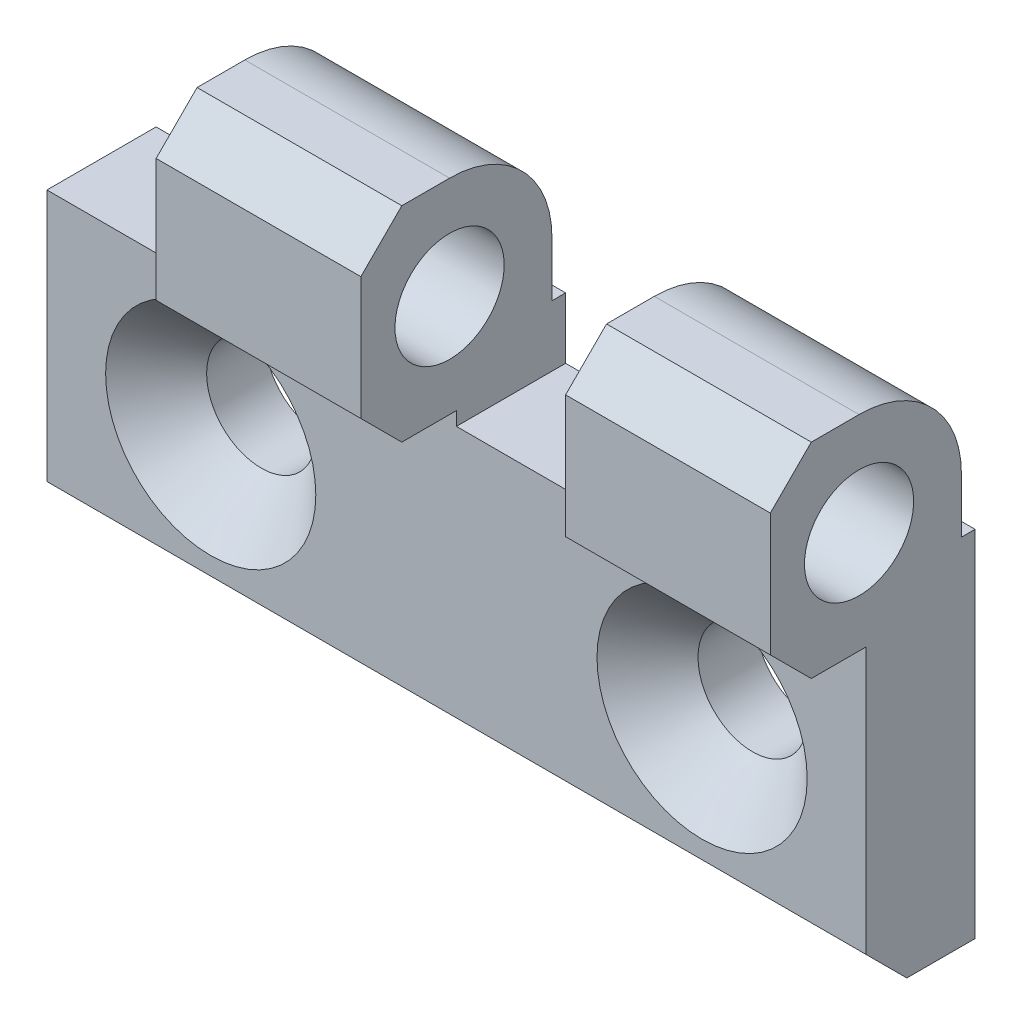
ISO-10303-21;
HEADER;
FILE_DESCRIPTION(('STEP AP214'),'2;1');
FILE_NAME('part.step','',(''),(''),'','','');
FILE_SCHEMA(('AUTOMOTIVE_DESIGN { 1 0 10303 214 1 1 1 1 }'));
ENDSEC;
DATA;
#1=APPLICATION_CONTEXT('core data for automotive mechanical design processes');
#2=APPLICATION_PROTOCOL_DEFINITION('international standard','automotive_design',2000,#1);
#3=PRODUCT_CONTEXT('',#1,'mechanical');
#4=PRODUCT('Part','Part','',(#3));
#5=PRODUCT_RELATED_PRODUCT_CATEGORY('part','',(#4));
#6=PRODUCT_DEFINITION_FORMATION('','',#4);
#7=PRODUCT_DEFINITION_CONTEXT('part definition',#1,'design');
#8=PRODUCT_DEFINITION('design','',#6,#7);
#9=PRODUCT_DEFINITION_SHAPE('','',#8);
#10=(LENGTH_UNIT() NAMED_UNIT(*) SI_UNIT(.MILLI.,.METRE.));
#11=(NAMED_UNIT(*) PLANE_ANGLE_UNIT() SI_UNIT($,.RADIAN.));
#12=(NAMED_UNIT(*) SI_UNIT($,.STERADIAN.) SOLID_ANGLE_UNIT());
#13=UNCERTAINTY_MEASURE_WITH_UNIT(LENGTH_MEASURE(1.E-05),#10,'distance_accuracy_value','');
#14=(GEOMETRIC_REPRESENTATION_CONTEXT(3) GLOBAL_UNCERTAINTY_ASSIGNED_CONTEXT((#13)) GLOBAL_UNIT_ASSIGNED_CONTEXT((#10,
#11,#12)) REPRESENTATION_CONTEXT('',''));
#15=CARTESIAN_POINT('',(0.,0.,0.));
#16=DIRECTION('',(0.,0.,1.));
#17=DIRECTION('',(1.,0.,0.));
#18=AXIS2_PLACEMENT_3D('',#15,#16,#17);
#19=CARTESIAN_POINT('',(-12.,-12.,8.));
#20=DIRECTION('',(0.,0.,-1.));
#21=DIRECTION('',(0.,1.,0.));
#22=AXIS2_PLACEMENT_3D('',#19,#20,#21);
#23=PLANE('',#22);
#24=CARTESIAN_POINT('',(36.,0.,8.));
#25=DIRECTION('',(0.,0.,-1.));
#26=DIRECTION('',(0.,1.,0.));
#27=AXIS2_PLACEMENT_3D('',#24,#25,#26);
#28=CIRCLE('',#27,7.7);
#29=CARTESIAN_POINT('',(36.,7.7,8.));
#30=VERTEX_POINT('',#29);
#31=EDGE_CURVE('E318',#30,#30,#28,.T.);
#32=ORIENTED_EDGE('',*,*,#31,.T.);
#33=EDGE_LOOP('',(#32));
#34=FACE_BOUND('',#33,.T.);
#35=CARTESIAN_POINT('',(0.,0.,8.));
#36=DIRECTION('',(0.,0.,-1.));
#37=DIRECTION('',(0.,1.,0.));
#38=AXIS2_PLACEMENT_3D('',#35,#36,#37);
#39=CIRCLE('',#38,7.7);
#40=CARTESIAN_POINT('',(0.,7.7,8.));
#41=VERTEX_POINT('',#40);
#42=EDGE_CURVE('E310',#41,#41,#39,.T.);
#43=ORIENTED_EDGE('',*,*,#42,.T.);
#44=EDGE_LOOP('',(#43));
#45=FACE_BOUND('',#44,.T.);
#46=DIRECTION('',(0.,1.,0.));
#47=VECTOR('',#46,1.);
#48=CARTESIAN_POINT('',(33.,-12.,8.));
#49=LINE('',#48,#47);
#50=CARTESIAN_POINT('',(33.,9.5,8.));
#51=VERTEX_POINT('',#50);
#52=CARTESIAN_POINT('',(33.,10.5,8.));
#53=VERTEX_POINT('',#52);
#54=EDGE_CURVE('E341',#51,#53,#49,.T.);
#55=ORIENTED_EDGE('',*,*,#54,.F.);
#56=DIRECTION('',(-1.,0.,0.));
#57=VECTOR('',#56,1.);
#58=CARTESIAN_POINT('',(-12.,9.5,8.));
#59=LINE('',#58,#57);
#60=CARTESIAN_POINT('',(18.,9.5,8.));
#61=VERTEX_POINT('',#60);
#62=EDGE_CURVE('E209',#51,#61,#59,.T.);
#63=ORIENTED_EDGE('',*,*,#62,.T.);
#64=DIRECTION('',(0.,1.,0.));
#65=VECTOR('',#64,1.);
#66=CARTESIAN_POINT('',(18.,-12.,8.));
#67=LINE('',#66,#65);
#68=CARTESIAN_POINT('',(18.,10.5,8.));
#69=VERTEX_POINT('',#68);
#70=EDGE_CURVE('E405',#61,#69,#67,.T.);
#71=ORIENTED_EDGE('',*,*,#70,.T.);
#72=DIRECTION('',(1.,0.,0.));
#73=VECTOR('',#72,1.);
#74=CARTESIAN_POINT('',(-12.,10.5,8.));
#75=LINE('',#74,#73);
#76=CARTESIAN_POINT('',(3.,10.5,8.));
#77=VERTEX_POINT('',#76);
#78=EDGE_CURVE('E271',#77,#69,#75,.T.);
#79=ORIENTED_EDGE('',*,*,#78,.F.);
#80=DIRECTION('',(0.,1.,0.));
#81=VECTOR('',#80,1.);
#82=CARTESIAN_POINT('',(3.,-12.,8.));
#83=LINE('',#82,#81);
#84=CARTESIAN_POINT('',(3.,9.5,8.));
#85=VERTEX_POINT('',#84);
#86=EDGE_CURVE('E380',#85,#77,#83,.T.);
#87=ORIENTED_EDGE('',*,*,#86,.F.);
#88=DIRECTION('',(-1.,0.,0.));
#89=VECTOR('',#88,1.);
#90=CARTESIAN_POINT('',(-12.,9.5,8.));
#91=LINE('',#90,#89);
#92=CARTESIAN_POINT('',(-12.,9.5,8.));
#93=VERTEX_POINT('',#92);
#94=EDGE_CURVE('E198',#85,#93,#91,.T.);
#95=ORIENTED_EDGE('',*,*,#94,.T.);
#96=DIRECTION('',(0.,1.,0.));
#97=VECTOR('',#96,1.);
#98=CARTESIAN_POINT('',(-12.,-12.,8.));
#99=LINE('',#98,#97);
#100=CARTESIAN_POINT('',(-12.,-9.,8.));
#101=VERTEX_POINT('',#100);
#102=EDGE_CURVE('E251',#101,#93,#99,.T.);
#103=ORIENTED_EDGE('',*,*,#102,.F.);
#104=DIRECTION('',(1.,0.,0.));
#105=VECTOR('',#104,1.);
#106=CARTESIAN_POINT('',(-12.,-9.,8.));
#107=LINE('',#106,#105);
#108=CARTESIAN_POINT('',(48.,-9.,8.));
#109=VERTEX_POINT('',#108);
#110=EDGE_CURVE('E272',#101,#109,#107,.T.);
#111=ORIENTED_EDGE('',*,*,#110,.T.);
#112=DIRECTION('',(0.,1.,0.));
#113=VECTOR('',#112,1.);
#114=CARTESIAN_POINT('',(48.,-12.,8.));
#115=LINE('',#114,#113);
#116=CARTESIAN_POINT('',(48.,10.5,8.));
#117=VERTEX_POINT('',#116);
#118=EDGE_CURVE('E224',#109,#117,#115,.T.);
#119=ORIENTED_EDGE('',*,*,#118,.T.);
#120=EDGE_CURVE('E269',#53,#117,#75,.T.);
#121=ORIENTED_EDGE('',*,*,#120,.F.);
#122=EDGE_LOOP('',(#55,#63,#71,#79,#87,#95,#103,#111,#119,#121));
#123=FACE_BOUND('',#122,.T.);
#124=ADVANCED_FACE('F14',(#34,#45,#123),#23,.F.);
#125=CARTESIAN_POINT('',(-12.,10.5,15.));
#126=DIRECTION('',(0.,-1.,0.));
#127=DIRECTION('',(0.,0.,-1.));
#128=AXIS2_PLACEMENT_3D('',#125,#126,#127);
#129=PLANE('',#128);
#130=DIRECTION('',(-1.,0.,0.));
#131=VECTOR('',#130,1.);
#132=CARTESIAN_POINT('',(-12.,10.5,12.));
#133=LINE('',#132,#131);
#134=CARTESIAN_POINT('',(48.,10.5,12.));
#135=VERTEX_POINT('',#134);
#136=CARTESIAN_POINT('',(33.,10.5,12.));
#137=VERTEX_POINT('',#136);
#138=EDGE_CURVE('E292',#135,#137,#133,.T.);
#139=ORIENTED_EDGE('',*,*,#138,.T.);
#140=DIRECTION('',(0.,0.,-1.));
#141=VECTOR('',#140,1.);
#142=CARTESIAN_POINT('',(33.,10.5,15.));
#143=LINE('',#142,#141);
#144=EDGE_CURVE('E347',#137,#53,#143,.T.);
#145=ORIENTED_EDGE('',*,*,#144,.T.);
#146=ORIENTED_EDGE('',*,*,#120,.T.);
#147=DIRECTION('',(0.,0.,-1.));
#148=VECTOR('',#147,1.);
#149=CARTESIAN_POINT('',(48.,10.5,15.));
#150=LINE('',#149,#148);
#151=EDGE_CURVE('E227',#135,#117,#150,.T.);
#152=ORIENTED_EDGE('',*,*,#151,.F.);
#153=EDGE_LOOP('',(#139,#145,#146,#152));
#154=FACE_BOUND('',#153,.T.);
#155=ADVANCED_FACE('F336',(#154),#129,.T.);
#156=DIRECTION('',(0.,0.,-1.));
#157=VECTOR('',#156,1.);
#158=CARTESIAN_POINT('',(18.,10.5,15.));
#159=LINE('',#158,#157);
#160=CARTESIAN_POINT('',(18.,10.5,12.));
#161=VERTEX_POINT('',#160);
#162=EDGE_CURVE('E403',#161,#69,#159,.T.);
#163=ORIENTED_EDGE('',*,*,#162,.F.);
#164=CARTESIAN_POINT('',(3.,10.5,12.));
#165=VERTEX_POINT('',#164);
#166=EDGE_CURVE('E296',#161,#165,#133,.T.);
#167=ORIENTED_EDGE('',*,*,#166,.T.);
#168=DIRECTION('',(0.,0.,-1.));
#169=VECTOR('',#168,1.);
#170=CARTESIAN_POINT('',(3.,10.5,15.));
#171=LINE('',#170,#169);
#172=EDGE_CURVE('E384',#165,#77,#171,.T.);
#173=ORIENTED_EDGE('',*,*,#172,.T.);
#174=ORIENTED_EDGE('',*,*,#78,.T.);
#175=EDGE_LOOP('',(#163,#167,#173,#174));
#176=FACE_BOUND('',#175,.T.);
#177=ADVANCED_FACE('F501',(#176),#129,.T.);
#178=CARTESIAN_POINT('',(-12.,10.5,15.));
#179=DIRECTION('',(0.,0.,-1.));
#180=DIRECTION('',(0.,1.,0.));
#181=AXIS2_PLACEMENT_3D('',#178,#179,#180);
#182=PLANE('',#181);
#183=DIRECTION('',(0.,1.,0.));
#184=VECTOR('',#183,1.);
#185=CARTESIAN_POINT('',(33.,10.5,15.));
#186=LINE('',#185,#184);
#187=CARTESIAN_POINT('',(33.,13.5,15.));
#188=VERTEX_POINT('',#187);
#189=CARTESIAN_POINT('',(33.,22.5,15.));
#190=VERTEX_POINT('',#189);
#191=EDGE_CURVE('E420',#188,#190,#186,.T.);
#192=ORIENTED_EDGE('',*,*,#191,.F.);
#193=DIRECTION('',(1.,0.,0.));
#194=VECTOR('',#193,1.);
#195=CARTESIAN_POINT('',(48.,13.5,15.));
#196=LINE('',#195,#194);
#197=CARTESIAN_POINT('',(48.,13.5,15.));
#198=VERTEX_POINT('',#197);
#199=EDGE_CURVE('E289',#188,#198,#196,.T.);
#200=ORIENTED_EDGE('',*,*,#199,.T.);
#201=DIRECTION('',(0.,1.,0.));
#202=VECTOR('',#201,1.);
#203=CARTESIAN_POINT('',(48.,10.5,15.));
#204=LINE('',#203,#202);
#205=CARTESIAN_POINT('',(48.,22.5,15.));
#206=VERTEX_POINT('',#205);
#207=EDGE_CURVE('E230',#198,#206,#204,.T.);
#208=ORIENTED_EDGE('',*,*,#207,.T.);
#209=DIRECTION('',(-1.,0.,0.));
#210=VECTOR('',#209,1.);
#211=CARTESIAN_POINT('',(-12.,22.5,15.));
#212=LINE('',#211,#210);
#213=EDGE_CURVE('E286',#206,#190,#212,.T.);
#214=ORIENTED_EDGE('',*,*,#213,.T.);
#215=EDGE_LOOP('',(#192,#200,#208,#214));
#216=FACE_BOUND('',#215,.T.);
#217=ADVANCED_FACE('F447',(#216),#182,.F.);
#218=CARTESIAN_POINT('',(3.,13.5,15.));
#219=VERTEX_POINT('',#218);
#220=CARTESIAN_POINT('',(18.,13.5,15.));
#221=VERTEX_POINT('',#220);
#222=EDGE_CURVE('E291',#219,#221,#196,.T.);
#223=ORIENTED_EDGE('',*,*,#222,.T.);
#224=DIRECTION('',(0.,1.,0.));
#225=VECTOR('',#224,1.);
#226=CARTESIAN_POINT('',(18.,10.5,15.));
#227=LINE('',#226,#225);
#228=CARTESIAN_POINT('',(18.,22.5,15.));
#229=VERTEX_POINT('',#228);
#230=EDGE_CURVE('E395',#221,#229,#227,.T.);
#231=ORIENTED_EDGE('',*,*,#230,.T.);
#232=CARTESIAN_POINT('',(3.,22.5,15.));
#233=VERTEX_POINT('',#232);
#234=EDGE_CURVE('E285',#229,#233,#212,.T.);
#235=ORIENTED_EDGE('',*,*,#234,.T.);
#236=DIRECTION('',(0.,1.,0.));
#237=VECTOR('',#236,1.);
#238=CARTESIAN_POINT('',(3.,10.5,15.));
#239=LINE('',#238,#237);
#240=EDGE_CURVE('E36',#219,#233,#239,.T.);
#241=ORIENTED_EDGE('',*,*,#240,.F.);
#242=EDGE_LOOP('',(#223,#231,#235,#241));
#243=FACE_BOUND('',#242,.T.);
#244=ADVANCED_FACE('F499',(#243),#182,.F.);
#245=CARTESIAN_POINT('',(-12.,25.5,15.));
#246=DIRECTION('',(0.,-1.,0.));
#247=DIRECTION('',(0.,0.,-1.));
#248=AXIS2_PLACEMENT_3D('',#245,#246,#247);
#249=PLANE('',#248);
#250=DIRECTION('',(0.,0.,-1.));
#251=VECTOR('',#250,1.);
#252=CARTESIAN_POINT('',(33.,25.5,15.));
#253=LINE('',#252,#251);
#254=CARTESIAN_POINT('',(33.,25.5,12.));
#255=VERTEX_POINT('',#254);
#256=CARTESIAN_POINT('',(33.,25.5,8.5));
#257=VERTEX_POINT('',#256);
#258=EDGE_CURVE('E418',#255,#257,#253,.T.);
#259=ORIENTED_EDGE('',*,*,#258,.F.);
#260=DIRECTION('',(1.,0.,0.));
#261=VECTOR('',#260,1.);
#262=CARTESIAN_POINT('',(-12.,25.5,12.));
#263=LINE('',#262,#261);
#264=CARTESIAN_POINT('',(48.,25.5,12.));
#265=VERTEX_POINT('',#264);
#266=EDGE_CURVE('E295',#255,#265,#263,.T.);
#267=ORIENTED_EDGE('',*,*,#266,.T.);
#268=DIRECTION('',(0.,0.,-1.));
#269=VECTOR('',#268,1.);
#270=CARTESIAN_POINT('',(48.,25.5,15.));
#271=LINE('',#270,#269);
#272=CARTESIAN_POINT('',(48.,25.5,8.5));
#273=VERTEX_POINT('',#272);
#274=EDGE_CURVE('E233',#265,#273,#271,.T.);
#275=ORIENTED_EDGE('',*,*,#274,.T.);
#276=DIRECTION('',(1.,0.,0.));
#277=VECTOR('',#276,1.);
#278=CARTESIAN_POINT('',(-12.,25.5,8.5));
#279=LINE('',#278,#277);
#280=EDGE_CURVE('E266',#257,#273,#279,.T.);
#281=ORIENTED_EDGE('',*,*,#280,.F.);
#282=EDGE_LOOP('',(#259,#267,#275,#281));
#283=FACE_BOUND('',#282,.T.);
#284=ADVANCED_FACE('F440',(#283),#249,.F.);
#285=CARTESIAN_POINT('',(3.,25.5,12.));
#286=VERTEX_POINT('',#285);
#287=CARTESIAN_POINT('',(18.,25.5,12.));
#288=VERTEX_POINT('',#287);
#289=EDGE_CURVE('E298',#286,#288,#263,.T.);
#290=ORIENTED_EDGE('',*,*,#289,.T.);
#291=DIRECTION('',(0.,0.,-1.));
#292=VECTOR('',#291,1.);
#293=CARTESIAN_POINT('',(18.,25.5,15.));
#294=LINE('',#293,#292);
#295=CARTESIAN_POINT('',(18.,25.5,8.5));
#296=VERTEX_POINT('',#295);
#297=EDGE_CURVE('E28',#288,#296,#294,.T.);
#298=ORIENTED_EDGE('',*,*,#297,.T.);
#299=CARTESIAN_POINT('',(3.,25.5,8.5));
#300=VERTEX_POINT('',#299);
#301=EDGE_CURVE('E268',#300,#296,#279,.T.);
#302=ORIENTED_EDGE('',*,*,#301,.F.);
#303=DIRECTION('',(0.,0.,-1.));
#304=VECTOR('',#303,1.);
#305=CARTESIAN_POINT('',(3.,25.5,15.));
#306=LINE('',#305,#304);
#307=EDGE_CURVE('E522',#286,#300,#306,.T.);
#308=ORIENTED_EDGE('',*,*,#307,.F.);
#309=EDGE_LOOP('',(#290,#298,#302,#308));
#310=FACE_BOUND('',#309,.T.);
#311=ADVANCED_FACE('F496',(#310),#249,.F.);
#312=CARTESIAN_POINT('',(-12.,18.,8.5));
#313=DIRECTION('',(1.,0.,0.));
#314=DIRECTION('',(0.,1.,0.));
#315=AXIS2_PLACEMENT_3D('',#312,#313,#314);
#316=CYLINDRICAL_SURFACE('',#315,7.5);
#317=CARTESIAN_POINT('',(33.,18.,8.5));
#318=DIRECTION('',(-1.,0.,0.));
#319=DIRECTION('',(0.,-1.,0.));
#320=AXIS2_PLACEMENT_3D('',#317,#318,#319);
#321=CIRCLE('',#320,7.5);
#322=CARTESIAN_POINT('',(33.,18.,1.));
#323=VERTEX_POINT('',#322);
#324=EDGE_CURVE('E351',#257,#323,#321,.T.);
#325=ORIENTED_EDGE('',*,*,#324,.F.);
#326=ORIENTED_EDGE('',*,*,#280,.T.);
#327=CARTESIAN_POINT('',(48.,18.,8.5));
#328=DIRECTION('',(-1.,0.,0.));
#329=DIRECTION('',(0.,-1.,0.));
#330=AXIS2_PLACEMENT_3D('',#327,#328,#329);
#331=CIRCLE('',#330,7.5);
#332=CARTESIAN_POINT('',(48.,18.,1.));
#333=VERTEX_POINT('',#332);
#334=EDGE_CURVE('E236',#273,#333,#331,.T.);
#335=ORIENTED_EDGE('',*,*,#334,.T.);
#336=DIRECTION('',(1.,0.,0.));
#337=VECTOR('',#336,1.);
#338=CARTESIAN_POINT('',(-12.,18.,1.));
#339=LINE('',#338,#337);
#340=EDGE_CURVE('E263',#323,#333,#339,.T.);
#341=ORIENTED_EDGE('',*,*,#340,.F.);
#342=EDGE_LOOP('',(#325,#326,#335,#341));
#343=FACE_BOUND('',#342,.T.);
#344=ADVANCED_FACE('F434',(#343),#316,.T.);
#345=ORIENTED_EDGE('',*,*,#301,.T.);
#346=CARTESIAN_POINT('',(18.,18.,8.5));
#347=DIRECTION('',(-1.,0.,0.));
#348=DIRECTION('',(0.,-1.,0.));
#349=AXIS2_PLACEMENT_3D('',#346,#347,#348);
#350=CIRCLE('',#349,7.5);
#351=CARTESIAN_POINT('',(18.,18.,1.));
#352=VERTEX_POINT('',#351);
#353=EDGE_CURVE('E400',#296,#352,#350,.T.);
#354=ORIENTED_EDGE('',*,*,#353,.T.);
#355=CARTESIAN_POINT('',(3.,18.,1.));
#356=VERTEX_POINT('',#355);
#357=EDGE_CURVE('E265',#356,#352,#339,.T.);
#358=ORIENTED_EDGE('',*,*,#357,.F.);
#359=CARTESIAN_POINT('',(3.,18.,8.5));
#360=DIRECTION('',(-1.,0.,0.));
#361=DIRECTION('',(0.,-1.,0.));
#362=AXIS2_PLACEMENT_3D('',#359,#360,#361);
#363=CIRCLE('',#362,7.5);
#364=EDGE_CURVE('E387',#300,#356,#363,.T.);
#365=ORIENTED_EDGE('',*,*,#364,.F.);
#366=EDGE_LOOP('',(#345,#354,#358,#365));
#367=FACE_BOUND('',#366,.T.);
#368=ADVANCED_FACE('F493',(#367),#316,.T.);
#369=CARTESIAN_POINT('',(-12.,18.,1.));
#370=DIRECTION('',(0.,0.,1.));
#371=DIRECTION('',(0.,-1.,0.));
#372=AXIS2_PLACEMENT_3D('',#369,#370,#371);
#373=PLANE('',#372);
#374=DIRECTION('',(0.,-1.,0.));
#375=VECTOR('',#374,1.);
#376=CARTESIAN_POINT('',(33.,18.,1.));
#377=LINE('',#376,#375);
#378=CARTESIAN_POINT('',(33.,13.97,1.));
#379=VERTEX_POINT('',#378);
#380=EDGE_CURVE('E346',#323,#379,#377,.T.);
#381=ORIENTED_EDGE('',*,*,#380,.F.);
#382=ORIENTED_EDGE('',*,*,#340,.T.);
#383=DIRECTION('',(0.,-1.,0.));
#384=VECTOR('',#383,1.);
#385=CARTESIAN_POINT('',(48.,18.,1.));
#386=LINE('',#385,#384);
#387=CARTESIAN_POINT('',(48.,13.97,1.));
#388=VERTEX_POINT('',#387);
#389=EDGE_CURVE('E239',#333,#388,#386,.T.);
#390=ORIENTED_EDGE('',*,*,#389,.T.);
#391=DIRECTION('',(1.,0.,0.));
#392=VECTOR('',#391,1.);
#393=CARTESIAN_POINT('',(-12.,13.97,1.));
#394=LINE('',#393,#392);
#395=EDGE_CURVE('E260',#379,#388,#394,.T.);
#396=ORIENTED_EDGE('',*,*,#395,.F.);
#397=EDGE_LOOP('',(#381,#382,#390,#396));
#398=FACE_BOUND('',#397,.T.);
#399=ADVANCED_FACE('F433',(#398),#373,.F.);
#400=ORIENTED_EDGE('',*,*,#357,.T.);
#401=DIRECTION('',(0.,-1.,0.));
#402=VECTOR('',#401,1.);
#403=CARTESIAN_POINT('',(18.,18.,1.));
#404=LINE('',#403,#402);
#405=CARTESIAN_POINT('',(18.,13.97,1.));
#406=VERTEX_POINT('',#405);
#407=EDGE_CURVE('E407',#352,#406,#404,.T.);
#408=ORIENTED_EDGE('',*,*,#407,.T.);
#409=CARTESIAN_POINT('',(3.,13.97,1.));
#410=VERTEX_POINT('',#409);
#411=EDGE_CURVE('E262',#410,#406,#394,.T.);
#412=ORIENTED_EDGE('',*,*,#411,.F.);
#413=DIRECTION('',(0.,-1.,0.));
#414=VECTOR('',#413,1.);
#415=CARTESIAN_POINT('',(3.,18.,1.));
#416=LINE('',#415,#414);
#417=EDGE_CURVE('E383',#356,#410,#416,.T.);
#418=ORIENTED_EDGE('',*,*,#417,.F.);
#419=EDGE_LOOP('',(#400,#408,#412,#418));
#420=FACE_BOUND('',#419,.T.);
#421=ADVANCED_FACE('F490',(#420),#373,.F.);
#422=CARTESIAN_POINT('',(-12.,13.97,1.));
#423=DIRECTION('',(0.,-1.,0.));
#424=DIRECTION('',(1.,0.,0.));
#425=AXIS2_PLACEMENT_3D('',#422,#423,#424);
#426=PLANE('',#425);
#427=DIRECTION('',(0.,0.,-1.));
#428=VECTOR('',#427,1.);
#429=CARTESIAN_POINT('',(33.,13.97,1.));
#430=LINE('',#429,#428);
#431=CARTESIAN_POINT('',(33.,13.97,0.));
#432=VERTEX_POINT('',#431);
#433=EDGE_CURVE('E349',#379,#432,#430,.T.);
#434=ORIENTED_EDGE('',*,*,#433,.F.);
#435=ORIENTED_EDGE('',*,*,#395,.T.);
#436=DIRECTION('',(0.,0.,-1.));
#437=VECTOR('',#436,1.);
#438=CARTESIAN_POINT('',(48.,13.97,1.));
#439=LINE('',#438,#437);
#440=CARTESIAN_POINT('',(48.,13.97,0.));
#441=VERTEX_POINT('',#440);
#442=EDGE_CURVE('E242',#388,#441,#439,.T.);
#443=ORIENTED_EDGE('',*,*,#442,.T.);
#444=DIRECTION('',(1.,0.,0.));
#445=VECTOR('',#444,1.);
#446=CARTESIAN_POINT('',(-12.,13.97,0.));
#447=LINE('',#446,#445);
#448=EDGE_CURVE('E257',#432,#441,#447,.T.);
#449=ORIENTED_EDGE('',*,*,#448,.F.);
#450=EDGE_LOOP('',(#434,#435,#443,#449));
#451=FACE_BOUND('',#450,.T.);
#452=ADVANCED_FACE('F362',(#451),#426,.F.);
#453=ORIENTED_EDGE('',*,*,#411,.T.);
#454=DIRECTION('',(0.,0.,-1.));
#455=VECTOR('',#454,1.);
#456=CARTESIAN_POINT('',(18.,13.97,1.));
#457=LINE('',#456,#455);
#458=CARTESIAN_POINT('',(18.,13.97,0.));
#459=VERTEX_POINT('',#458);
#460=EDGE_CURVE('E410',#406,#459,#457,.T.);
#461=ORIENTED_EDGE('',*,*,#460,.T.);
#462=CARTESIAN_POINT('',(3.,13.97,0.));
#463=VERTEX_POINT('',#462);
#464=EDGE_CURVE('E259',#463,#459,#447,.T.);
#465=ORIENTED_EDGE('',*,*,#464,.F.);
#466=DIRECTION('',(0.,0.,-1.));
#467=VECTOR('',#466,1.);
#468=CARTESIAN_POINT('',(3.,13.97,1.));
#469=LINE('',#468,#467);
#470=EDGE_CURVE('E186',#410,#463,#469,.T.);
#471=ORIENTED_EDGE('',*,*,#470,.F.);
#472=EDGE_LOOP('',(#453,#461,#465,#471));
#473=FACE_BOUND('',#472,.T.);
#474=ADVANCED_FACE('F486',(#473),#426,.F.);
#475=CARTESIAN_POINT('',(-12.,-12.,0.));
#476=DIRECTION('',(0.,0.,-1.));
#477=DIRECTION('',(-1.,0.,0.));
#478=AXIS2_PLACEMENT_3D('',#475,#476,#477);
#479=PLANE('',#478);
#480=CARTESIAN_POINT('',(0.,0.,0.));
#481=DIRECTION('',(0.,0.,-1.));
#482=DIRECTION('',(-1.,0.,0.));
#483=AXIS2_PLACEMENT_3D('',#480,#481,#482);
#484=CIRCLE('',#483,4.);
#485=CARTESIAN_POINT('',(-4.,0.,0.));
#486=VERTEX_POINT('',#485);
#487=EDGE_CURVE('E313',#486,#486,#484,.T.);
#488=ORIENTED_EDGE('',*,*,#487,.F.);
#489=EDGE_LOOP('',(#488));
#490=FACE_BOUND('',#489,.T.);
#491=CARTESIAN_POINT('',(36.,0.,0.));
#492=DIRECTION('',(0.,0.,-1.));
#493=DIRECTION('',(-1.,0.,0.));
#494=AXIS2_PLACEMENT_3D('',#491,#492,#493);
#495=CIRCLE('',#494,4.);
#496=CARTESIAN_POINT('',(32.,0.,0.));
#497=VERTEX_POINT('',#496);
#498=EDGE_CURVE('E200',#497,#497,#495,.T.);
#499=ORIENTED_EDGE('',*,*,#498,.F.);
#500=EDGE_LOOP('',(#499));
#501=FACE_BOUND('',#500,.T.);
#502=DIRECTION('',(-1.,0.,0.));
#503=VECTOR('',#502,1.);
#504=CARTESIAN_POINT('',(-12.,9.5,0.));
#505=LINE('',#504,#503);
#506=CARTESIAN_POINT('',(33.,9.5,0.));
#507=VERTEX_POINT('',#506);
#508=CARTESIAN_POINT('',(18.,9.5,0.));
#509=VERTEX_POINT('',#508);
#510=EDGE_CURVE('E308',#507,#509,#505,.T.);
#511=ORIENTED_EDGE('',*,*,#510,.F.);
#512=DIRECTION('',(0.,1.,0.));
#513=VECTOR('',#512,1.);
#514=CARTESIAN_POINT('',(33.,-12.,0.));
#515=LINE('',#514,#513);
#516=EDGE_CURVE('E212',#507,#432,#515,.T.);
#517=ORIENTED_EDGE('',*,*,#516,.T.);
#518=ORIENTED_EDGE('',*,*,#448,.T.);
#519=DIRECTION('',(0.,1.,0.));
#520=VECTOR('',#519,1.);
#521=CARTESIAN_POINT('',(48.,-12.,0.));
#522=LINE('',#521,#520);
#523=CARTESIAN_POINT('',(48.,-12.,0.));
#524=VERTEX_POINT('',#523);
#525=EDGE_CURVE('E245',#524,#441,#522,.T.);
#526=ORIENTED_EDGE('',*,*,#525,.F.);
#527=DIRECTION('',(1.,0.,0.));
#528=VECTOR('',#527,1.);
#529=CARTESIAN_POINT('',(-12.,-12.,0.));
#530=LINE('',#529,#528);
#531=CARTESIAN_POINT('',(-12.,-12.,0.));
#532=VERTEX_POINT('',#531);
#533=EDGE_CURVE('E255',#532,#524,#530,.T.);
#534=ORIENTED_EDGE('',*,*,#533,.F.);
#535=DIRECTION('',(0.,1.,0.));
#536=VECTOR('',#535,1.);
#537=CARTESIAN_POINT('',(-12.,-12.,0.));
#538=LINE('',#537,#536);
#539=CARTESIAN_POINT('',(-12.,9.5,0.));
#540=VERTEX_POINT('',#539);
#541=EDGE_CURVE('E206',#532,#540,#538,.T.);
#542=ORIENTED_EDGE('',*,*,#541,.T.);
#543=DIRECTION('',(-1.,0.,0.));
#544=VECTOR('',#543,1.);
#545=CARTESIAN_POINT('',(-12.,9.5,0.));
#546=LINE('',#545,#544);
#547=CARTESIAN_POINT('',(3.,9.5,0.));
#548=VERTEX_POINT('',#547);
#549=EDGE_CURVE('E195',#548,#540,#546,.T.);
#550=ORIENTED_EDGE('',*,*,#549,.F.);
#551=DIRECTION('',(0.,1.,0.));
#552=VECTOR('',#551,1.);
#553=CARTESIAN_POINT('',(3.,-12.,0.));
#554=LINE('',#553,#552);
#555=EDGE_CURVE('E179',#548,#463,#554,.T.);
#556=ORIENTED_EDGE('',*,*,#555,.T.);
#557=ORIENTED_EDGE('',*,*,#464,.T.);
#558=DIRECTION('',(0.,1.,0.));
#559=VECTOR('',#558,1.);
#560=CARTESIAN_POINT('',(18.,-12.,0.));
#561=LINE('',#560,#559);
#562=EDGE_CURVE('E413',#509,#459,#561,.T.);
#563=ORIENTED_EDGE('',*,*,#562,.F.);
#564=EDGE_LOOP('',(#511,#517,#518,#526,#534,#542,#550,#556,#557,#563));
#565=FACE_BOUND('',#564,.T.);
#566=ADVANCED_FACE('F204',(#490,#501,#565),#479,.T.);
#567=CARTESIAN_POINT('',(-12.,18.,8.5));
#568=DIRECTION('',(1.,0.,0.));
#569=DIRECTION('',(0.,1.,0.));
#570=AXIS2_PLACEMENT_3D('',#567,#568,#569);
#571=CYLINDRICAL_SURFACE('',#570,4.);
#572=CARTESIAN_POINT('',(48.,18.,8.5));
#573=DIRECTION('',(1.,0.,0.));
#574=DIRECTION('',(0.,1.,0.));
#575=AXIS2_PLACEMENT_3D('',#572,#573,#574);
#576=CIRCLE('',#575,4.);
#577=CARTESIAN_POINT('',(48.,22.,8.5));
#578=VERTEX_POINT('',#577);
#579=EDGE_CURVE('E218',#578,#578,#576,.T.);
#580=ORIENTED_EDGE('',*,*,#579,.T.);
#581=EDGE_LOOP('',(#580));
#582=FACE_BOUND('',#581,.T.);
#583=CARTESIAN_POINT('',(33.,18.,8.5));
#584=DIRECTION('',(-1.,0.,0.));
#585=DIRECTION('',(0.,-1.,0.));
#586=AXIS2_PLACEMENT_3D('',#583,#584,#585);
#587=CIRCLE('',#586,4.);
#588=CARTESIAN_POINT('',(33.,14.,8.5));
#589=VERTEX_POINT('',#588);
#590=EDGE_CURVE('E207',#589,#589,#587,.F.);
#591=ORIENTED_EDGE('',*,*,#590,.F.);
#592=EDGE_LOOP('',(#591));
#593=FACE_BOUND('',#592,.T.);
#594=ADVANCED_FACE('F457',(#582,#593),#571,.F.);
#595=CARTESIAN_POINT('',(-12.,13.5,15.));
#596=DIRECTION('',(0.,-0.707106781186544,0.707106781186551));
#597=DIRECTION('',(0.,-0.707106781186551,-0.707106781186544));
#598=AXIS2_PLACEMENT_3D('',#595,#596,#597);
#599=PLANE('',#598);
#600=ORIENTED_EDGE('',*,*,#199,.F.);
#601=DIRECTION('',(0.,-0.707106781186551,-0.707106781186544));
#602=VECTOR('',#601,1.);
#603=CARTESIAN_POINT('',(33.,13.5,15.));
#604=LINE('',#603,#602);
#605=EDGE_CURVE('E422',#188,#137,#604,.T.);
#606=ORIENTED_EDGE('',*,*,#605,.T.);
#607=ORIENTED_EDGE('',*,*,#138,.F.);
#608=DIRECTION('',(0.,-0.707106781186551,-0.707106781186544));
#609=VECTOR('',#608,1.);
#610=CARTESIAN_POINT('',(48.,13.5,15.));
#611=LINE('',#610,#609);
#612=EDGE_CURVE('E277',#198,#135,#611,.T.);
#613=ORIENTED_EDGE('',*,*,#612,.F.);
#614=EDGE_LOOP('',(#600,#606,#607,#613));
#615=FACE_BOUND('',#614,.T.);
#616=ADVANCED_FACE('F454',(#615),#599,.T.);
#617=DIRECTION('',(0.,-0.707106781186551,-0.707106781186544));
#618=VECTOR('',#617,1.);
#619=CARTESIAN_POINT('',(18.,13.5,15.));
#620=LINE('',#619,#618);
#621=EDGE_CURVE('E398',#221,#161,#620,.T.);
#622=ORIENTED_EDGE('',*,*,#621,.F.);
#623=ORIENTED_EDGE('',*,*,#222,.F.);
#624=DIRECTION('',(0.,-0.707106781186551,-0.707106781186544));
#625=VECTOR('',#624,1.);
#626=CARTESIAN_POINT('',(3.,13.5,15.));
#627=LINE('',#626,#625);
#628=EDGE_CURVE('E518',#219,#165,#627,.T.);
#629=ORIENTED_EDGE('',*,*,#628,.T.);
#630=ORIENTED_EDGE('',*,*,#166,.F.);
#631=EDGE_LOOP('',(#622,#623,#629,#630));
#632=FACE_BOUND('',#631,.T.);
#633=ADVANCED_FACE('F456',(#632),#599,.T.);
#634=CARTESIAN_POINT('',(-12.,25.5,12.));
#635=DIRECTION('',(0.,-0.707106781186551,-0.707106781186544));
#636=DIRECTION('',(0.,0.707106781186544,-0.707106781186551));
#637=AXIS2_PLACEMENT_3D('',#634,#635,#636);
#638=PLANE('',#637);
#639=ORIENTED_EDGE('',*,*,#266,.F.);
#640=DIRECTION('',(0.,0.707106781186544,-0.707106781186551));
#641=VECTOR('',#640,1.);
#642=CARTESIAN_POINT('',(33.,25.5,12.));
#643=LINE('',#642,#641);
#644=EDGE_CURVE('E303',#255,#190,#643,.F.);
#645=ORIENTED_EDGE('',*,*,#644,.T.);
#646=ORIENTED_EDGE('',*,*,#213,.F.);
#647=DIRECTION('',(0.,0.707106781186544,-0.707106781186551));
#648=VECTOR('',#647,1.);
#649=CARTESIAN_POINT('',(48.,25.5,12.));
#650=LINE('',#649,#648);
#651=EDGE_CURVE('E275',#265,#206,#650,.F.);
#652=ORIENTED_EDGE('',*,*,#651,.F.);
#653=EDGE_LOOP('',(#639,#645,#646,#652));
#654=FACE_BOUND('',#653,.T.);
#655=ADVANCED_FACE('F444',(#654),#638,.F.);
#656=DIRECTION('',(0.,0.707106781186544,-0.707106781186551));
#657=VECTOR('',#656,1.);
#658=CARTESIAN_POINT('',(18.,25.5,12.));
#659=LINE('',#658,#657);
#660=EDGE_CURVE('E301',#288,#229,#659,.F.);
#661=ORIENTED_EDGE('',*,*,#660,.F.);
#662=ORIENTED_EDGE('',*,*,#289,.F.);
#663=DIRECTION('',(0.,0.707106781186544,-0.707106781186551));
#664=VECTOR('',#663,1.);
#665=CARTESIAN_POINT('',(3.,25.5,12.));
#666=LINE('',#665,#664);
#667=EDGE_CURVE('E299',#286,#233,#666,.F.);
#668=ORIENTED_EDGE('',*,*,#667,.T.);
#669=ORIENTED_EDGE('',*,*,#234,.F.);
#670=EDGE_LOOP('',(#661,#662,#668,#669));
#671=FACE_BOUND('',#670,.T.);
#672=ADVANCED_FACE('F483',(#671),#638,.F.);
#673=CARTESIAN_POINT('',(-12.,-12.,0.));
#674=DIRECTION('',(0.,1.,0.));
#675=DIRECTION('',(-1.,0.,0.));
#676=AXIS2_PLACEMENT_3D('',#673,#674,#675);
#677=PLANE('',#676);
#678=DIRECTION('',(0.,0.,1.));
#679=VECTOR('',#678,1.);
#680=CARTESIAN_POINT('',(48.,-12.,0.));
#681=LINE('',#680,#679);
#682=CARTESIAN_POINT('',(48.,-12.,5.));
#683=VERTEX_POINT('',#682);
#684=EDGE_CURVE('E221',#524,#683,#681,.T.);
#685=ORIENTED_EDGE('',*,*,#684,.T.);
#686=DIRECTION('',(-1.,0.,0.));
#687=VECTOR('',#686,1.);
#688=CARTESIAN_POINT('',(-12.,-12.,5.));
#689=LINE('',#688,#687);
#690=CARTESIAN_POINT('',(-12.,-12.,5.));
#691=VERTEX_POINT('',#690);
#692=EDGE_CURVE('E281',#683,#691,#689,.T.);
#693=ORIENTED_EDGE('',*,*,#692,.T.);
#694=DIRECTION('',(0.,0.,1.));
#695=VECTOR('',#694,1.);
#696=CARTESIAN_POINT('',(-12.,-12.,0.));
#697=LINE('',#696,#695);
#698=EDGE_CURVE('E248',#532,#691,#697,.T.);
#699=ORIENTED_EDGE('',*,*,#698,.F.);
#700=ORIENTED_EDGE('',*,*,#533,.T.);
#701=EDGE_LOOP('',(#685,#693,#699,#700));
#702=FACE_BOUND('',#701,.T.);
#703=ADVANCED_FACE('F372',(#702),#677,.F.);
#704=CARTESIAN_POINT('',(-12.,18.,8.5));
#705=DIRECTION('',(-1.,0.,0.));
#706=DIRECTION('',(0.,-1.,0.));
#707=AXIS2_PLACEMENT_3D('',#704,#705,#706);
#708=PLANE('',#707);
#709=DIRECTION('',(0.,0.,1.));
#710=VECTOR('',#709,1.);
#711=CARTESIAN_POINT('',(-12.,9.5,8.5));
#712=LINE('',#711,#710);
#713=EDGE_CURVE('E306',#540,#93,#712,.T.);
#714=ORIENTED_EDGE('',*,*,#713,.F.);
#715=ORIENTED_EDGE('',*,*,#541,.F.);
#716=ORIENTED_EDGE('',*,*,#698,.T.);
#717=DIRECTION('',(0.,-0.707106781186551,-0.707106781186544));
#718=VECTOR('',#717,1.);
#719=CARTESIAN_POINT('',(-12.,4.75000000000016,21.75));
#720=LINE('',#719,#718);
#721=EDGE_CURVE('E283',#691,#101,#720,.F.);
#722=ORIENTED_EDGE('',*,*,#721,.T.);
#723=ORIENTED_EDGE('',*,*,#102,.T.);
#724=EDGE_LOOP('',(#714,#715,#716,#722,#723));
#725=FACE_BOUND('',#724,.T.);
#726=ADVANCED_FACE('F376',(#725),#708,.T.);
#727=CARTESIAN_POINT('',(48.,18.,8.5));
#728=DIRECTION('',(-1.,0.,0.));
#729=DIRECTION('',(0.,-1.,0.));
#730=AXIS2_PLACEMENT_3D('',#727,#728,#729);
#731=PLANE('',#730);
#732=ORIENTED_EDGE('',*,*,#579,.F.);
#733=EDGE_LOOP('',(#732));
#734=FACE_BOUND('',#733,.T.);
#735=ORIENTED_EDGE('',*,*,#118,.F.);
#736=DIRECTION('',(0.,0.707106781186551,0.707106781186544));
#737=VECTOR('',#736,1.);
#738=CARTESIAN_POINT('',(48.,-9.,8.));
#739=LINE('',#738,#737);
#740=EDGE_CURVE('E279',#109,#683,#739,.F.);
#741=ORIENTED_EDGE('',*,*,#740,.T.);
#742=ORIENTED_EDGE('',*,*,#684,.F.);
#743=ORIENTED_EDGE('',*,*,#525,.T.);
#744=ORIENTED_EDGE('',*,*,#442,.F.);
#745=ORIENTED_EDGE('',*,*,#389,.F.);
#746=ORIENTED_EDGE('',*,*,#334,.F.);
#747=ORIENTED_EDGE('',*,*,#274,.F.);
#748=ORIENTED_EDGE('',*,*,#651,.T.);
#749=ORIENTED_EDGE('',*,*,#207,.F.);
#750=ORIENTED_EDGE('',*,*,#612,.T.);
#751=ORIENTED_EDGE('',*,*,#151,.T.);
#752=EDGE_LOOP('',(#735,#741,#742,#743,#744,#745,#746,#747,#748,#749,#750,#751));
#753=FACE_BOUND('',#752,.T.);
#754=ADVANCED_FACE('F369',(#734,#753),#731,.F.);
#755=CARTESIAN_POINT('',(-12.,-9.,8.));
#756=DIRECTION('',(0.,0.707106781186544,-0.707106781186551));
#757=DIRECTION('',(0.,0.707106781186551,0.707106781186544));
#758=AXIS2_PLACEMENT_3D('',#755,#756,#757);
#759=PLANE('',#758);
#760=ORIENTED_EDGE('',*,*,#721,.F.);
#761=ORIENTED_EDGE('',*,*,#692,.F.);
#762=ORIENTED_EDGE('',*,*,#740,.F.);
#763=ORIENTED_EDGE('',*,*,#110,.F.);
#764=EDGE_LOOP('',(#760,#761,#762,#763));
#765=FACE_BOUND('',#764,.T.);
#766=ADVANCED_FACE('F472',(#765),#759,.F.);
#767=CARTESIAN_POINT('',(3.,38.,-5.));
#768=DIRECTION('',(-1.,0.,0.));
#769=DIRECTION('',(0.,-1.,0.));
#770=AXIS2_PLACEMENT_3D('',#767,#768,#769);
#771=PLANE('',#770);
#772=DIRECTION('',(0.,0.,1.));
#773=VECTOR('',#772,1.);
#774=CARTESIAN_POINT('',(3.,9.5,-5.));
#775=LINE('',#774,#773);
#776=EDGE_CURVE('E183',#548,#85,#775,.T.);
#777=ORIENTED_EDGE('',*,*,#776,.T.);
#778=ORIENTED_EDGE('',*,*,#86,.T.);
#779=ORIENTED_EDGE('',*,*,#172,.F.);
#780=ORIENTED_EDGE('',*,*,#628,.F.);
#781=ORIENTED_EDGE('',*,*,#240,.T.);
#782=ORIENTED_EDGE('',*,*,#667,.F.);
#783=ORIENTED_EDGE('',*,*,#307,.T.);
#784=ORIENTED_EDGE('',*,*,#364,.T.);
#785=ORIENTED_EDGE('',*,*,#417,.T.);
#786=ORIENTED_EDGE('',*,*,#470,.T.);
#787=ORIENTED_EDGE('',*,*,#555,.F.);
#788=EDGE_LOOP('',(#777,#778,#779,#780,#781,#782,#783,#784,#785,#786,#787));
#789=FACE_BOUND('',#788,.T.);
#790=CARTESIAN_POINT('',(3.,18.,8.5));
#791=DIRECTION('',(-1.,0.,0.));
#792=DIRECTION('',(0.,-1.,0.));
#793=AXIS2_PLACEMENT_3D('',#790,#791,#792);
#794=CIRCLE('',#793,4.);
#795=CARTESIAN_POINT('',(3.,14.,8.5));
#796=VERTEX_POINT('',#795);
#797=EDGE_CURVE('E191',#796,#796,#794,.F.);
#798=ORIENTED_EDGE('',*,*,#797,.T.);
#799=EDGE_LOOP('',(#798));
#800=FACE_BOUND('',#799,.T.);
#801=ADVANCED_FACE('F181',(#789,#800),#771,.T.);
#802=CARTESIAN_POINT('',(-24.5,9.5,-5.));
#803=DIRECTION('',(0.,-1.,0.));
#804=DIRECTION('',(0.,0.,-1.));
#805=AXIS2_PLACEMENT_3D('',#802,#803,#804);
#806=PLANE('',#805);
#807=ORIENTED_EDGE('',*,*,#776,.F.);
#808=ORIENTED_EDGE('',*,*,#549,.T.);
#809=ORIENTED_EDGE('',*,*,#713,.T.);
#810=ORIENTED_EDGE('',*,*,#94,.F.);
#811=EDGE_LOOP('',(#807,#808,#809,#810));
#812=FACE_BOUND('',#811,.T.);
#813=ADVANCED_FACE('F194',(#812),#806,.F.);
#814=CARTESIAN_POINT('',(18.,9.5,-5.));
#815=DIRECTION('',(0.,-1.,0.));
#816=DIRECTION('',(0.,0.,-1.));
#817=AXIS2_PLACEMENT_3D('',#814,#815,#816);
#818=PLANE('',#817);
#819=DIRECTION('',(0.,0.,1.));
#820=VECTOR('',#819,1.);
#821=CARTESIAN_POINT('',(33.,9.5,-5.));
#822=LINE('',#821,#820);
#823=EDGE_CURVE('E525',#507,#51,#822,.T.);
#824=ORIENTED_EDGE('',*,*,#823,.F.);
#825=ORIENTED_EDGE('',*,*,#510,.T.);
#826=DIRECTION('',(0.,0.,1.));
#827=VECTOR('',#826,1.);
#828=CARTESIAN_POINT('',(18.,9.5,-5.));
#829=LINE('',#828,#827);
#830=EDGE_CURVE('E199',#509,#61,#829,.T.);
#831=ORIENTED_EDGE('',*,*,#830,.T.);
#832=ORIENTED_EDGE('',*,*,#62,.F.);
#833=EDGE_LOOP('',(#824,#825,#831,#832));
#834=FACE_BOUND('',#833,.T.);
#835=ADVANCED_FACE('F723',(#834),#818,.F.);
#836=CARTESIAN_POINT('',(33.,38.,-5.));
#837=DIRECTION('',(-1.,0.,0.));
#838=DIRECTION('',(0.,-1.,0.));
#839=AXIS2_PLACEMENT_3D('',#836,#837,#838);
#840=PLANE('',#839);
#841=ORIENTED_EDGE('',*,*,#823,.T.);
#842=ORIENTED_EDGE('',*,*,#54,.T.);
#843=ORIENTED_EDGE('',*,*,#144,.F.);
#844=ORIENTED_EDGE('',*,*,#605,.F.);
#845=ORIENTED_EDGE('',*,*,#191,.T.);
#846=ORIENTED_EDGE('',*,*,#644,.F.);
#847=ORIENTED_EDGE('',*,*,#258,.T.);
#848=ORIENTED_EDGE('',*,*,#324,.T.);
#849=ORIENTED_EDGE('',*,*,#380,.T.);
#850=ORIENTED_EDGE('',*,*,#433,.T.);
#851=ORIENTED_EDGE('',*,*,#516,.F.);
#852=EDGE_LOOP('',(#841,#842,#843,#844,#845,#846,#847,#848,#849,#850,#851));
#853=FACE_BOUND('',#852,.T.);
#854=ORIENTED_EDGE('',*,*,#590,.T.);
#855=EDGE_LOOP('',(#854));
#856=FACE_BOUND('',#855,.T.);
#857=ADVANCED_FACE('F426',(#853,#856),#840,.T.);
#858=CARTESIAN_POINT('',(18.,38.,-5.));
#859=DIRECTION('',(-1.,0.,0.));
#860=DIRECTION('',(0.,-1.,0.));
#861=AXIS2_PLACEMENT_3D('',#858,#859,#860);
#862=PLANE('',#861);
#863=ORIENTED_EDGE('',*,*,#562,.T.);
#864=ORIENTED_EDGE('',*,*,#460,.F.);
#865=ORIENTED_EDGE('',*,*,#407,.F.);
#866=ORIENTED_EDGE('',*,*,#353,.F.);
#867=ORIENTED_EDGE('',*,*,#297,.F.);
#868=ORIENTED_EDGE('',*,*,#660,.T.);
#869=ORIENTED_EDGE('',*,*,#230,.F.);
#870=ORIENTED_EDGE('',*,*,#621,.T.);
#871=ORIENTED_EDGE('',*,*,#162,.T.);
#872=ORIENTED_EDGE('',*,*,#70,.F.);
#873=ORIENTED_EDGE('',*,*,#830,.F.);
#874=EDGE_LOOP('',(#863,#864,#865,#866,#867,#868,#869,#870,#871,#872,#873));
#875=FACE_BOUND('',#874,.T.);
#876=CARTESIAN_POINT('',(18.,18.,8.5));
#877=DIRECTION('',(-1.,0.,0.));
#878=DIRECTION('',(0.,-1.,0.));
#879=AXIS2_PLACEMENT_3D('',#876,#877,#878);
#880=CIRCLE('',#879,4.);
#881=CARTESIAN_POINT('',(18.,14.,8.5));
#882=VERTEX_POINT('',#881);
#883=EDGE_CURVE('E415',#882,#882,#880,.F.);
#884=ORIENTED_EDGE('',*,*,#883,.F.);
#885=EDGE_LOOP('',(#884));
#886=FACE_BOUND('',#885,.T.);
#887=ADVANCED_FACE('F539',(#875,#886),#862,.F.);
#888=ORIENTED_EDGE('',*,*,#883,.T.);
#889=EDGE_LOOP('',(#888));
#890=FACE_BOUND('',#889,.T.);
#891=ORIENTED_EDGE('',*,*,#797,.F.);
#892=EDGE_LOOP('',(#891));
#893=FACE_BOUND('',#892,.T.);
#894=ADVANCED_FACE('F468',(#890,#893),#571,.F.);
#895=CARTESIAN_POINT('',(36.,0.,15.));
#896=DIRECTION('',(0.,0.,-1.));
#897=DIRECTION('',(-1.,0.,0.));
#898=AXIS2_PLACEMENT_3D('',#895,#896,#897);
#899=CYLINDRICAL_SURFACE('',#898,4.);
#900=CARTESIAN_POINT('',(36.,0.,4.3));
#901=DIRECTION('',(0.,0.,-1.));
#902=DIRECTION('',(-1.,0.,0.));
#903=AXIS2_PLACEMENT_3D('',#900,#901,#902);
#904=CIRCLE('',#903,4.);
#905=CARTESIAN_POINT('',(32.,0.,4.3));
#906=VERTEX_POINT('',#905);
#907=EDGE_CURVE('E21',#906,#906,#904,.F.);
#908=ORIENTED_EDGE('',*,*,#907,.T.);
#909=EDGE_LOOP('',(#908));
#910=FACE_BOUND('',#909,.T.);
#911=ORIENTED_EDGE('',*,*,#498,.T.);
#912=EDGE_LOOP('',(#911));
#913=FACE_BOUND('',#912,.T.);
#914=ADVANCED_FACE('F323',(#910,#913),#899,.F.);
#915=CARTESIAN_POINT('',(0.,0.,15.));
#916=DIRECTION('',(0.,0.,-1.));
#917=DIRECTION('',(-1.,0.,0.));
#918=AXIS2_PLACEMENT_3D('',#915,#916,#917);
#919=CYLINDRICAL_SURFACE('',#918,4.);
#920=CARTESIAN_POINT('',(0.,0.,4.3));
#921=DIRECTION('',(0.,0.,-1.));
#922=DIRECTION('',(-1.,0.,0.));
#923=AXIS2_PLACEMENT_3D('',#920,#921,#922);
#924=CIRCLE('',#923,4.);
#925=CARTESIAN_POINT('',(-4.,0.,4.3));
#926=VERTEX_POINT('',#925);
#927=EDGE_CURVE('E9',#926,#926,#924,.F.);
#928=ORIENTED_EDGE('',*,*,#927,.T.);
#929=EDGE_LOOP('',(#928));
#930=FACE_BOUND('',#929,.T.);
#931=ORIENTED_EDGE('',*,*,#487,.T.);
#932=EDGE_LOOP('',(#931));
#933=FACE_BOUND('',#932,.T.);
#934=ADVANCED_FACE('F330',(#930,#933),#919,.F.);
#935=CARTESIAN_POINT('',(36.,0.,8.));
#936=DIRECTION('',(0.,0.,1.));
#937=DIRECTION('',(1.,0.,0.));
#938=AXIS2_PLACEMENT_3D('',#935,#936,#937);
#939=CONICAL_SURFACE('',#938,7.7,0.785398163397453);
#940=ORIENTED_EDGE('',*,*,#907,.F.);
#941=EDGE_LOOP('',(#940));
#942=FACE_BOUND('',#941,.T.);
#943=ORIENTED_EDGE('',*,*,#31,.F.);
#944=EDGE_LOOP('',(#943));
#945=FACE_BOUND('',#944,.T.);
#946=ADVANCED_FACE('F326',(#942,#945),#939,.F.);
#947=CARTESIAN_POINT('',(0.,0.,8.));
#948=DIRECTION('',(0.,0.,1.));
#949=DIRECTION('',(1.,0.,0.));
#950=AXIS2_PLACEMENT_3D('',#947,#948,#949);
#951=CONICAL_SURFACE('',#950,7.7,0.785398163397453);
#952=ORIENTED_EDGE('',*,*,#927,.F.);
#953=EDGE_LOOP('',(#952));
#954=FACE_BOUND('',#953,.T.);
#955=ORIENTED_EDGE('',*,*,#42,.F.);
#956=EDGE_LOOP('',(#955));
#957=FACE_BOUND('',#956,.T.);
#958=ADVANCED_FACE('F329',(#954,#957),#951,.F.);
#959=CLOSED_SHELL('',(#124,#155,#177,#217,#244,#284,#311,#344,#368,#399,#421,#452,#474,#566,
#594,#616,#633,#655,#672,#703,#726,#754,#766,#801,#813,#835,#857,#887,#894,#914,#934,#946,#958));
#960=MANIFOLD_SOLID_BREP('B1',#959);
#961=ADVANCED_BREP_SHAPE_REPRESENTATION('',(#18,#960),#14);
#962=SHAPE_DEFINITION_REPRESENTATION(#9,#961);
ENDSEC;
END-ISO-10303-21;
